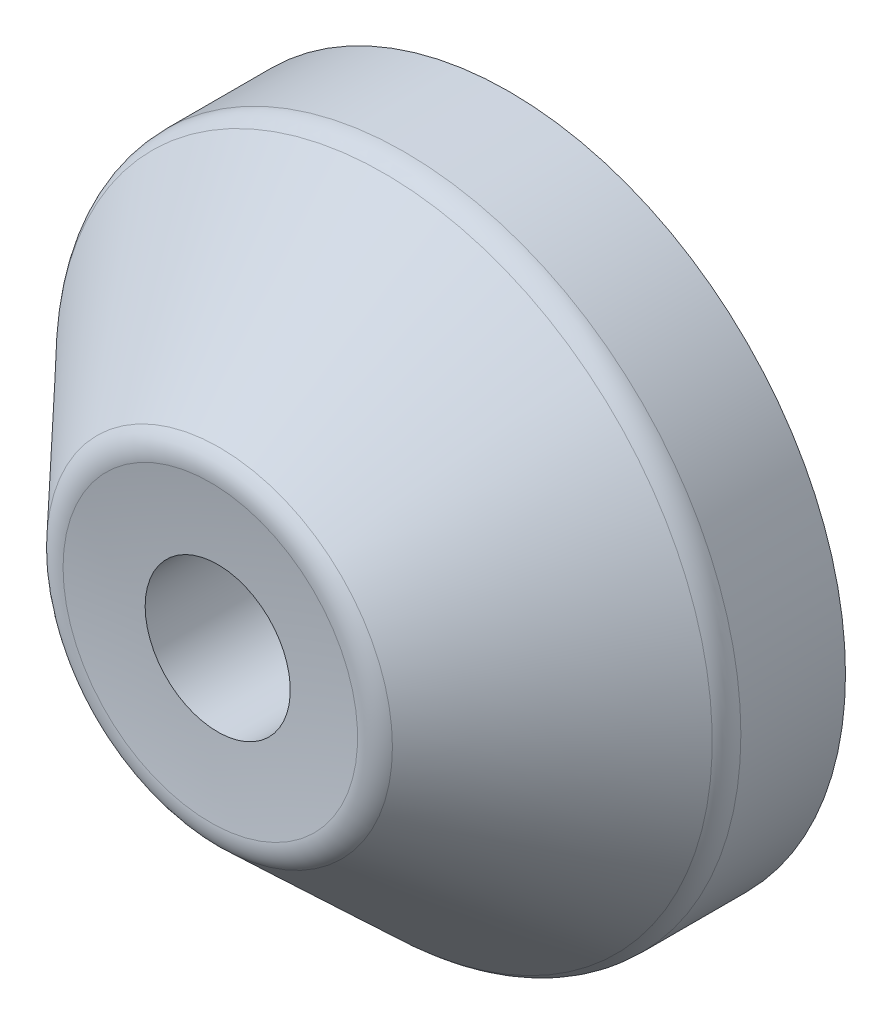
ISO-10303-21;
HEADER;
FILE_DESCRIPTION(('STEP AP214'),'2;1');
FILE_NAME('part.step','',(''),(''),'','','');
FILE_SCHEMA(('AUTOMOTIVE_DESIGN { 1 0 10303 214 1 1 1 1 }'));
ENDSEC;
DATA;
#1=APPLICATION_CONTEXT('core data for automotive mechanical design processes');
#2=APPLICATION_PROTOCOL_DEFINITION('international standard','automotive_design',2000,#1);
#3=PRODUCT_CONTEXT('',#1,'mechanical');
#4=PRODUCT('Part','Part','',(#3));
#5=PRODUCT_RELATED_PRODUCT_CATEGORY('part','',(#4));
#6=PRODUCT_DEFINITION_FORMATION('','',#4);
#7=PRODUCT_DEFINITION_CONTEXT('part definition',#1,'design');
#8=PRODUCT_DEFINITION('design','',#6,#7);
#9=PRODUCT_DEFINITION_SHAPE('','',#8);
#10=(LENGTH_UNIT() NAMED_UNIT(*) SI_UNIT(.MILLI.,.METRE.));
#11=(NAMED_UNIT(*) PLANE_ANGLE_UNIT() SI_UNIT($,.RADIAN.));
#12=(NAMED_UNIT(*) SI_UNIT($,.STERADIAN.) SOLID_ANGLE_UNIT());
#13=UNCERTAINTY_MEASURE_WITH_UNIT(LENGTH_MEASURE(1.E-05),#10,'distance_accuracy_value','');
#14=(GEOMETRIC_REPRESENTATION_CONTEXT(3) GLOBAL_UNCERTAINTY_ASSIGNED_CONTEXT((#13)) GLOBAL_UNIT_ASSIGNED_CONTEXT((#10,
#11,#12)) REPRESENTATION_CONTEXT('',''));
#15=CARTESIAN_POINT('',(0.,0.,0.));
#16=DIRECTION('',(0.,0.,1.));
#17=DIRECTION('',(1.,0.,0.));
#18=AXIS2_PLACEMENT_3D('',#15,#16,#17);
#19=CARTESIAN_POINT('',(0.,0.,1.59254973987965));
#20=DIRECTION('',(0.,0.,-1.));
#21=DIRECTION('',(-1.,0.,0.));
#22=AXIS2_PLACEMENT_3D('',#19,#20,#21);
#23=TOROIDAL_SURFACE('',#22,9.38475144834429,7.17288142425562);
#24=CARTESIAN_POINT('',(0.,0.,2.5));
#25=DIRECTION('',(0.,0.,-1.));
#26=DIRECTION('',(-1.,0.,0.));
#27=AXIS2_PLACEMENT_3D('',#24,#25,#26);
#28=CIRCLE('',#27,16.5);
#29=CARTESIAN_POINT('',(-16.5,0.,2.5));
#30=VERTEX_POINT('',#29);
#31=EDGE_CURVE('E65',#30,#30,#28,.T.);
#32=ORIENTED_EDGE('',*,*,#31,.T.);
#33=EDGE_LOOP('',(#32));
#34=FACE_BOUND('',#33,.T.);
#35=CARTESIAN_POINT('',(0.,0.,8.75000000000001));
#36=DIRECTION('',(0.,0.,-1.));
#37=DIRECTION('',(-1.,0.,0.));
#38=AXIS2_PLACEMENT_3D('',#35,#36,#37);
#39=CIRCLE('',#38,9.855);
#40=CARTESIAN_POINT('',(-9.855,0.,8.75000000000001));
#41=VERTEX_POINT('',#40);
#42=EDGE_CURVE('E18',#41,#41,#39,.T.);
#43=ORIENTED_EDGE('',*,*,#42,.F.);
#44=EDGE_LOOP('',(#43));
#45=FACE_BOUND('',#44,.T.);
#46=ADVANCED_FACE('F14',(#34,#45),#23,.F.);
#47=CARTESIAN_POINT('',(0.,0.,1.25));
#48=DIRECTION('',(0.,0.,-1.));
#49=DIRECTION('',(-1.,0.,0.));
#50=AXIS2_PLACEMENT_3D('',#47,#48,#49);
#51=CYLINDRICAL_SURFACE('',#50,16.5);
#52=CARTESIAN_POINT('',(0.,0.,0.));
#53=DIRECTION('',(0.,0.,-1.));
#54=DIRECTION('',(-1.,0.,0.));
#55=AXIS2_PLACEMENT_3D('',#52,#53,#54);
#56=CIRCLE('',#55,16.5);
#57=CARTESIAN_POINT('',(-16.5,0.,0.));
#58=VERTEX_POINT('',#57);
#59=EDGE_CURVE('E74',#58,#58,#56,.F.);
#60=ORIENTED_EDGE('',*,*,#59,.F.);
#61=EDGE_LOOP('',(#60));
#62=FACE_BOUND('',#61,.T.);
#63=ORIENTED_EDGE('',*,*,#31,.F.);
#64=EDGE_LOOP('',(#63));
#65=FACE_BOUND('',#64,.T.);
#66=ADVANCED_FACE('F84',(#62,#65),#51,.F.);
#67=CARTESIAN_POINT('',(-7.355,0.,8.75));
#68=DIRECTION('',(0.,0.,-1.));
#69=DIRECTION('',(-1.,0.,0.));
#70=AXIS2_PLACEMENT_3D('',#67,#68,#69);
#71=PLANE('',#70);
#72=CARTESIAN_POINT('',(0.,0.,8.75));
#73=DIRECTION('',(0.,0.,-1.));
#74=DIRECTION('',(-1.,0.,0.));
#75=AXIS2_PLACEMENT_3D('',#72,#73,#74);
#76=CIRCLE('',#75,4.855);
#77=CARTESIAN_POINT('',(-4.855,0.,8.75));
#78=VERTEX_POINT('',#77);
#79=EDGE_CURVE('E72',#78,#78,#76,.F.);
#80=ORIENTED_EDGE('',*,*,#79,.T.);
#81=EDGE_LOOP('',(#80));
#82=FACE_BOUND('',#81,.T.);
#83=ORIENTED_EDGE('',*,*,#42,.T.);
#84=EDGE_LOOP('',(#83));
#85=FACE_BOUND('',#84,.T.);
#86=ADVANCED_FACE('F81',(#82,#85),#71,.T.);
#87=CARTESIAN_POINT('',(-19.5,0.,0.));
#88=DIRECTION('',(0.,0.,-1.));
#89=DIRECTION('',(-1.,0.,0.));
#90=AXIS2_PLACEMENT_3D('',#87,#88,#89);
#91=PLANE('',#90);
#92=ORIENTED_EDGE('',*,*,#59,.T.);
#93=EDGE_LOOP('',(#92));
#94=FACE_BOUND('',#93,.T.);
#95=CARTESIAN_POINT('',(0.,0.,0.));
#96=DIRECTION('',(0.,0.,-1.));
#97=DIRECTION('',(-1.,0.,0.));
#98=AXIS2_PLACEMENT_3D('',#95,#96,#97);
#99=CIRCLE('',#98,22.5);
#100=CARTESIAN_POINT('',(-22.5,0.,0.));
#101=VERTEX_POINT('',#100);
#102=EDGE_CURVE('E62',#101,#101,#99,.F.);
#103=ORIENTED_EDGE('',*,*,#102,.F.);
#104=EDGE_LOOP('',(#103));
#105=FACE_BOUND('',#104,.T.);
#106=ADVANCED_FACE('F105',(#94,#105),#91,.T.);
#107=CARTESIAN_POINT('',(0.,0.,14.1285062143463));
#108=DIRECTION('',(0.,0.,-1.));
#109=DIRECTION('',(-1.,0.,0.));
#110=AXIS2_PLACEMENT_3D('',#107,#108,#109);
#111=CYLINDRICAL_SURFACE('',#110,4.855);
#112=ORIENTED_EDGE('',*,*,#79,.F.);
#113=EDGE_LOOP('',(#112));
#114=FACE_BOUND('',#113,.T.);
#115=CARTESIAN_POINT('',(0.,0.,19.5070124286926));
#116=DIRECTION('',(0.,0.,-1.));
#117=DIRECTION('',(-1.,0.,0.));
#118=AXIS2_PLACEMENT_3D('',#115,#116,#117);
#119=CIRCLE('',#118,4.85500000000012);
#120=CARTESIAN_POINT('',(-4.85500000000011,0.,19.5070124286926));
#121=VERTEX_POINT('',#120);
#122=EDGE_CURVE('E57',#121,#121,#119,.T.);
#123=ORIENTED_EDGE('',*,*,#122,.F.);
#124=EDGE_LOOP('',(#123));
#125=FACE_BOUND('',#124,.T.);
#126=ADVANCED_FACE('F102',(#114,#125),#111,.F.);
#127=CARTESIAN_POINT('',(0.,0.,3.5));
#128=DIRECTION('',(0.,0.,-1.));
#129=DIRECTION('',(-1.,0.,0.));
#130=AXIS2_PLACEMENT_3D('',#127,#128,#129);
#131=CYLINDRICAL_SURFACE('',#130,22.5);
#132=CARTESIAN_POINT('',(0.,0.,7.));
#133=DIRECTION('',(0.,0.,-1.));
#134=DIRECTION('',(-1.,0.,0.));
#135=AXIS2_PLACEMENT_3D('',#132,#133,#134);
#136=CIRCLE('',#135,22.5);
#137=CARTESIAN_POINT('',(-22.5,0.,7.));
#138=VERTEX_POINT('',#137);
#139=EDGE_CURVE('E54',#138,#138,#136,.F.);
#140=ORIENTED_EDGE('',*,*,#139,.F.);
#141=EDGE_LOOP('',(#140));
#142=FACE_BOUND('',#141,.T.);
#143=ORIENTED_EDGE('',*,*,#102,.T.);
#144=EDGE_LOOP('',(#143));
#145=FACE_BOUND('',#144,.T.);
#146=ADVANCED_FACE('F49',(#142,#145),#131,.T.);
#147=CARTESIAN_POINT('',(-1.9298798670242E-13,0.,94.3497072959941));
#148=DIRECTION('',(0.,0.,1.));
#149=DIRECTION('',(-1.,0.,0.));
#150=AXIS2_PLACEMENT_3D('',#147,#148,#149);
#151=SPHERICAL_SURFACE('',#150,75.);
#152=CARTESIAN_POINT('',(0.,0.,20.));
#153=DIRECTION('',(0.,0.,-1.));
#154=DIRECTION('',(-1.,0.,0.));
#155=AXIS2_PLACEMENT_3D('',#152,#153,#154);
#156=CIRCLE('',#155,9.855);
#157=CARTESIAN_POINT('',(-9.85500000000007,0.,20.));
#158=VERTEX_POINT('',#157);
#159=EDGE_CURVE('E27',#158,#158,#156,.T.);
#160=CARTESIAN_POINT('',(-4.85500000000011,0.,19.5070124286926));
#161=CARTESIAN_POINT('',(-4.90723588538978,0.,19.510400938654));
#162=CARTESIAN_POINT('',(-4.95946822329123,0.,19.5138441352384));
#163=CARTESIAN_POINT('',(-5.06392557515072,0.,19.5208398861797));
#164=CARTESIAN_POINT('',(-5.11615058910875,0.,19.5243924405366));
#165=CARTESIAN_POINT('',(-5.2205930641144,0.,19.5316068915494));
#166=CARTESIAN_POINT('',(-5.27281052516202,0.,19.5352687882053));
#167=CARTESIAN_POINT('',(-5.37723766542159,0.,19.5427019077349));
#168=CARTESIAN_POINT('',(-5.42944734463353,0.,19.5464731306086));
#169=CARTESIAN_POINT('',(-5.53385869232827,0.,19.5541248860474));
#170=CARTESIAN_POINT('',(-5.58606036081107,0.,19.5580054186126));
#171=CARTESIAN_POINT('',(-5.6904554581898,0.,19.5658757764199));
#172=CARTESIAN_POINT('',(-5.74264888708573,0.,19.569865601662));
#173=CARTESIAN_POINT('',(-5.84702727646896,0.,19.5779545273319));
#174=CARTESIAN_POINT('',(-5.89921223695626,0.,19.5820536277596));
#175=CARTESIAN_POINT('',(-6.00357346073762,0.,19.5903610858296));
#176=CARTESIAN_POINT('',(-6.05574972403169,0.,19.5945694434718));
#177=CARTESIAN_POINT('',(-6.16009332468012,0.,19.6030953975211));
#178=CARTESIAN_POINT('',(-6.21226066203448,0.,19.607412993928));
#179=CARTESIAN_POINT('',(-6.31658618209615,0.,19.6161574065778));
#180=CARTESIAN_POINT('',(-6.36874436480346,0.,19.6205842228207));
#181=CARTESIAN_POINT('',(-6.47305134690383,0.,19.6295470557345));
#182=CARTESIAN_POINT('',(-6.52520014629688,0.,19.6340830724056));
#183=CARTESIAN_POINT('',(-6.62948813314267,0.,19.6432642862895));
#184=CARTESIAN_POINT('',(-6.6816273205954,0.,19.6479094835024));
#185=CARTESIAN_POINT('',(-6.78589585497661,0.,19.6573090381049));
#186=CARTESIAN_POINT('',(-6.83802520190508,0.,19.6620633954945));
#187=CARTESIAN_POINT('',(-6.94227382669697,0.,19.671681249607));
#188=CARTESIAN_POINT('',(-6.99439310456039,0.,19.6765447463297));
#189=CARTESIAN_POINT('',(-7.09862136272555,0.,19.6863808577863));
#190=CARTESIAN_POINT('',(-7.15073034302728,0.,19.6913534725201));
#191=CARTESIAN_POINT('',(-7.25493777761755,0.,19.7014077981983));
#192=CARTESIAN_POINT('',(-7.30703623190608,0.,19.7064895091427));
#193=CARTESIAN_POINT('',(-7.41122238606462,0.,19.7167620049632));
#194=CARTESIAN_POINT('',(-7.46331008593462,0.,19.7219527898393));
#195=CARTESIAN_POINT('',(-7.56747450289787,0.,19.7324434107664));
#196=CARTESIAN_POINT('',(-7.61955121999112,0.,19.7377432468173));
#197=CARTESIAN_POINT('',(-7.72369344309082,0.,19.7484519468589));
#198=CARTESIAN_POINT('',(-7.77575894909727,0.,19.7538608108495));
#199=CARTESIAN_POINT('',(-7.87987852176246,0.,19.7647875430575));
#200=CARTESIAN_POINT('',(-7.93193258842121,0.,19.7703054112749));
#201=CARTESIAN_POINT('',(-8.03602905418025,0.,19.7814501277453));
#202=CARTESIAN_POINT('',(-8.08807145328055,0.,19.7870769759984));
#203=CARTESIAN_POINT('',(-8.19214435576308,0.,19.7984396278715));
#204=CARTESIAN_POINT('',(-8.24417485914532,0.,19.8041754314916));
#205=CARTESIAN_POINT('',(-8.34822374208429,0.,19.8157559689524));
#206=CARTESIAN_POINT('',(-8.40024212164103,0.,19.8216007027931));
#207=CARTESIAN_POINT('',(-8.50426652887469,0.,19.8333990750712));
#208=CARTESIAN_POINT('',(-8.55627255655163,0.,19.8393527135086));
#209=CARTESIAN_POINT('',(-8.66027203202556,0.,19.8513688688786));
#210=CARTESIAN_POINT('',(-8.71226547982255,0.,19.8574313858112));
#211=CARTESIAN_POINT('',(-8.8162395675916,0.,19.869665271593));
#212=CARTESIAN_POINT('',(-8.86822020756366,0.,19.8758366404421));
#213=CARTESIAN_POINT('',(-8.972168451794,0.,19.8882882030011));
#214=CARTESIAN_POINT('',(-9.02413605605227,0.,19.8945683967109));
#215=CARTESIAN_POINT('',(-9.12805800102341,0.,19.9072375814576));
#216=CARTESIAN_POINT('',(-9.18001234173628,0.,19.9136265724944));
#217=CARTESIAN_POINT('',(-9.28390753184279,0.,19.9265133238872));
#218=CARTESIAN_POINT('',(-9.33584838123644,0.,19.9330110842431));
#219=CARTESIAN_POINT('',(-9.43971636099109,0.,19.9461153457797));
#220=CARTESIAN_POINT('',(-9.49164349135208,0.,19.9527218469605));
#221=CARTESIAN_POINT('',(-9.59548380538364,0.,19.9660435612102));
#222=CARTESIAN_POINT('',(-9.6473969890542,0.,19.9727587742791));
#223=CARTESIAN_POINT('',(-9.75120918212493,0.,19.9862978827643));
#224=CARTESIAN_POINT('',(-9.80310819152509,0.,19.9931217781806));
#225=CARTESIAN_POINT('',(-9.85500000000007,0.,20.));
#226=B_SPLINE_CURVE_WITH_KNOTS('',3,(#160,#161,#162,#163,#164,#165,#166,#167,#168,#169,#170,
#171,#172,#173,#174,#175,#176,#177,#178,#179,#180,#181,#182,#183,#184,#185,#186,#187,#188,#189,
#190,#191,#192,#193,#194,#195,#196,#197,#198,#199,#200,#201,#202,#203,#204,#205,#206,#207,#208,
#209,#210,#211,#212,#213,#214,#215,#216,#217,#218,#219,#220,#221,#222,#223,#224,#225),
.UNSPECIFIED.,.F.,.F.,(4,2,2,2,2,2,2,2,2,2,2,2,2,2,2,2,2,2,2,2,2,2,2,2,2,2,2,2,2,2,2,2,4),(0.,
0.15703699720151,0.31407399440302,0.471110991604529,0.628147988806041,0.785184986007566,
0.942221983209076,1.09925898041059,1.2562959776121,1.41333297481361,1.57036997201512,
1.72740696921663,1.88444396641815,2.04148096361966,2.19851796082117,2.35555495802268,
2.51259195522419,2.6696289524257,2.82666594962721,2.98370294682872,3.14073994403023,
3.29777694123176,3.45481393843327,3.61185093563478,3.76888793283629,3.9259249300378,
4.08296192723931,4.23999892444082,4.39703592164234,4.55407291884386,4.71110991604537,
4.86814691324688,5.02518391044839),.UNSPECIFIED.);
#227=EDGE_CURVE('BSEAM16',#121,#158,#226,.T.);
#228=ORIENTED_EDGE('',*,*,#122,.T.);
#229=ORIENTED_EDGE('',*,*,#159,.F.);
#230=ORIENTED_EDGE('',*,*,#227,.T.);
#231=ORIENTED_EDGE('',*,*,#227,.F.);
#232=EDGE_LOOP('',(#228,#230,#229,#231));
#233=FACE_BOUND('',#232,.T.);
#234=ADVANCED_FACE('F16',(#233),#151,.F.);
#235=CARTESIAN_POINT('',(0.,0.,7.));
#236=DIRECTION('',(0.,0.,-1.));
#237=DIRECTION('',(-1.,0.,0.));
#238=AXIS2_PLACEMENT_3D('',#235,#236,#237);
#239=TOROIDAL_SURFACE('',#238,20.5,2.00000000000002);
#240=CARTESIAN_POINT('',(0.,0.,8.37163550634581));
#241=DIRECTION('',(0.,0.,-1.));
#242=DIRECTION('',(-1.,0.,0.));
#243=AXIS2_PLACEMENT_3D('',#240,#241,#242);
#244=CIRCLE('',#243,21.9555466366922);
#245=CARTESIAN_POINT('',(-21.9555466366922,0.,8.37163550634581));
#246=VERTEX_POINT('',#245);
#247=EDGE_CURVE('E22',#246,#246,#244,.F.);
#248=ORIENTED_EDGE('',*,*,#247,.F.);
#249=EDGE_LOOP('',(#248));
#250=FACE_BOUND('',#249,.T.);
#251=ORIENTED_EDGE('',*,*,#139,.T.);
#252=EDGE_LOOP('',(#251));
#253=FACE_BOUND('',#252,.T.);
#254=ADVANCED_FACE('F43',(#250,#253),#239,.T.);
#255=CARTESIAN_POINT('',(0.,0.,18.0173411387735));
#256=DIRECTION('',(0.,0.,-1.));
#257=DIRECTION('',(-1.,0.,0.));
#258=AXIS2_PLACEMENT_3D('',#255,#256,#257);
#259=TOROIDAL_SURFACE('',#258,10.1178,1.99999999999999);
#260=ORIENTED_EDGE('',*,*,#159,.T.);
#261=EDGE_LOOP('',(#260));
#262=FACE_BOUND('',#261,.T.);
#263=CARTESIAN_POINT('',(0.,0.,19.3889766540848));
#264=DIRECTION('',(0.,0.,-1.));
#265=DIRECTION('',(-1.,0.,0.));
#266=AXIS2_PLACEMENT_3D('',#263,#264,#265);
#267=CIRCLE('',#266,11.5733466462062);
#268=CARTESIAN_POINT('',(-11.5733466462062,0.,19.3889766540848));
#269=VERTEX_POINT('',#268);
#270=EDGE_CURVE('E10',#269,#269,#267,.T.);
#271=ORIENTED_EDGE('',*,*,#270,.F.);
#272=EDGE_LOOP('',(#271));
#273=FACE_BOUND('',#272,.T.);
#274=ADVANCED_FACE('F38',(#262,#273),#259,.T.);
#275=CARTESIAN_POINT('',(0.,0.,8.37163550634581));
#276=DIRECTION('',(0.,0.,-1.));
#277=DIRECTION('',(-1.,0.,0.));
#278=AXIS2_PLACEMENT_3D('',#275,#276,#277);
#279=CONICAL_SURFACE('',#278,21.9555466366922,0.75572674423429);
#280=ORIENTED_EDGE('',*,*,#270,.T.);
#281=EDGE_LOOP('',(#280));
#282=FACE_BOUND('',#281,.T.);
#283=ORIENTED_EDGE('',*,*,#247,.T.);
#284=EDGE_LOOP('',(#283));
#285=FACE_BOUND('',#284,.T.);
#286=ADVANCED_FACE('F42',(#282,#285),#279,.T.);
#287=CLOSED_SHELL('',(#46,#66,#86,#106,#126,#146,#234,#254,#274,#286));
#288=MANIFOLD_SOLID_BREP('B1',#287);
#289=ADVANCED_BREP_SHAPE_REPRESENTATION('',(#18,#288),#14);
#290=SHAPE_DEFINITION_REPRESENTATION(#9,#289);
ENDSEC;
END-ISO-10303-21;
